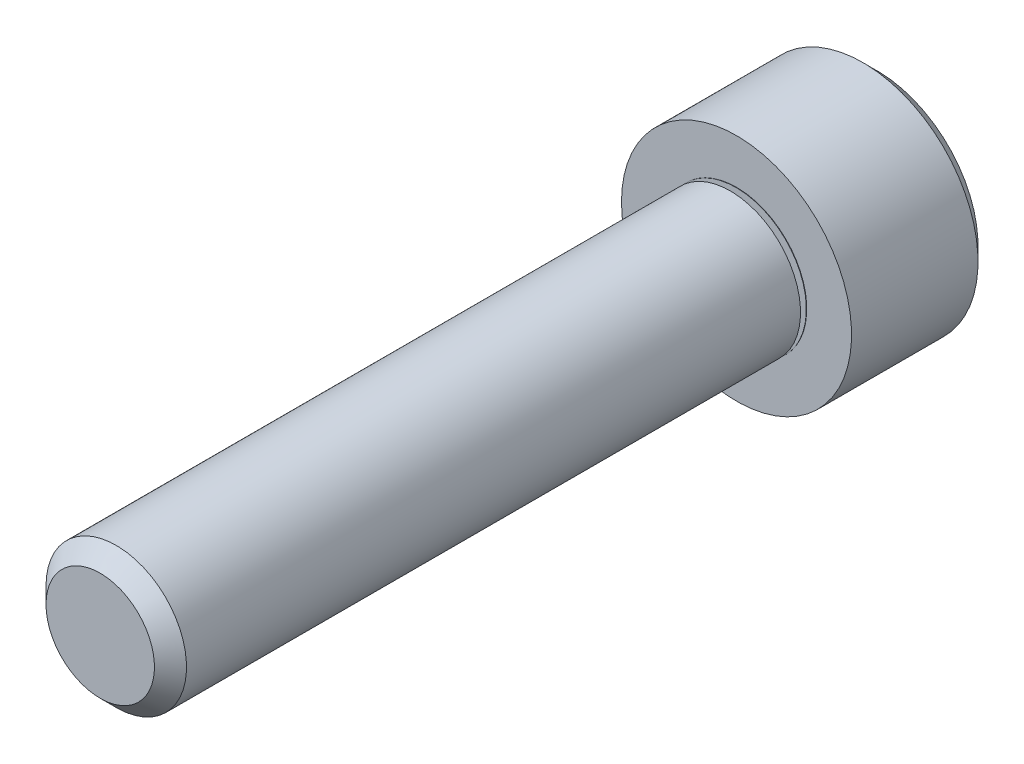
ISO-10303-21;
HEADER;
FILE_DESCRIPTION(('STEP AP214'),'2;1');
FILE_NAME('part.step','',(''),(''),'','','');
FILE_SCHEMA(('AUTOMOTIVE_DESIGN { 1 0 10303 214 1 1 1 1 }'));
ENDSEC;
DATA;
#1=APPLICATION_CONTEXT('core data for automotive mechanical design processes');
#2=APPLICATION_PROTOCOL_DEFINITION('international standard','automotive_design',2000,#1);
#3=PRODUCT_CONTEXT('',#1,'mechanical');
#4=PRODUCT('Part','Part','',(#3));
#5=PRODUCT_RELATED_PRODUCT_CATEGORY('part','',(#4));
#6=PRODUCT_DEFINITION_FORMATION('','',#4);
#7=PRODUCT_DEFINITION_CONTEXT('part definition',#1,'design');
#8=PRODUCT_DEFINITION('design','',#6,#7);
#9=PRODUCT_DEFINITION_SHAPE('','',#8);
#10=(LENGTH_UNIT() NAMED_UNIT(*) SI_UNIT(.MILLI.,.METRE.));
#11=(NAMED_UNIT(*) PLANE_ANGLE_UNIT() SI_UNIT($,.RADIAN.));
#12=(NAMED_UNIT(*) SI_UNIT($,.STERADIAN.) SOLID_ANGLE_UNIT());
#13=UNCERTAINTY_MEASURE_WITH_UNIT(LENGTH_MEASURE(1.E-05),#10,'distance_accuracy_value','');
#14=(GEOMETRIC_REPRESENTATION_CONTEXT(3) GLOBAL_UNCERTAINTY_ASSIGNED_CONTEXT((#13)) GLOBAL_UNIT_ASSIGNED_CONTEXT((#10,
#11,#12)) REPRESENTATION_CONTEXT('',''));
#15=CARTESIAN_POINT('',(0.,0.,0.));
#16=DIRECTION('',(0.,0.,1.));
#17=DIRECTION('',(1.,0.,0.));
#18=AXIS2_PLACEMENT_3D('',#15,#16,#17);
#19=CARTESIAN_POINT('',(0.,0.,-3.5052));
#20=DIRECTION('',(0.,0.,1.));
#21=DIRECTION('',(1.,0.,0.));
#22=AXIS2_PLACEMENT_3D('',#19,#20,#21);
#23=PLANE('',#22);
#24=DIRECTION('',(-0.5,-0.866025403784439,0.));
#25=VECTOR('',#24,1.);
#26=CARTESIAN_POINT('',(1.60395121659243,0.,-3.5052));
#27=LINE('',#26,#25);
#28=CARTESIAN_POINT('',(1.60395121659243,0.,-3.5052));
#29=VERTEX_POINT('',#28);
#30=CARTESIAN_POINT('',(0.80197560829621,-1.38906250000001,-3.5052));
#31=VERTEX_POINT('',#30);
#32=EDGE_CURVE('E145',#29,#31,#27,.T.);
#33=ORIENTED_EDGE('',*,*,#32,.F.);
#34=DIRECTION('',(0.5,-0.866025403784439,0.));
#35=VECTOR('',#34,1.);
#36=CARTESIAN_POINT('',(0.801975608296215,1.3890625,-3.5052));
#37=LINE('',#36,#35);
#38=CARTESIAN_POINT('',(0.801975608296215,1.3890625,-3.5052));
#39=VERTEX_POINT('',#38);
#40=EDGE_CURVE('E64',#39,#29,#37,.T.);
#41=ORIENTED_EDGE('',*,*,#40,.F.);
#42=DIRECTION('',(1.,0.,0.));
#43=VECTOR('',#42,1.);
#44=CARTESIAN_POINT('',(-0.801975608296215,1.3890625,-3.5052));
#45=LINE('',#44,#43);
#46=CARTESIAN_POINT('',(-0.801975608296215,1.3890625,-3.5052));
#47=VERTEX_POINT('',#46);
#48=EDGE_CURVE('E158',#47,#39,#45,.T.);
#49=ORIENTED_EDGE('',*,*,#48,.F.);
#50=DIRECTION('',(0.5,0.866025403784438,0.));
#51=VECTOR('',#50,1.);
#52=CARTESIAN_POINT('',(-1.60395121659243,0.,-3.5052));
#53=LINE('',#52,#51);
#54=CARTESIAN_POINT('',(-1.60395121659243,0.,-3.5052));
#55=VERTEX_POINT('',#54);
#56=EDGE_CURVE('E155',#55,#47,#53,.T.);
#57=ORIENTED_EDGE('',*,*,#56,.F.);
#58=DIRECTION('',(-0.499999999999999,0.866025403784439,0.));
#59=VECTOR('',#58,1.);
#60=CARTESIAN_POINT('',(-0.801975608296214,-1.38906250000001,-3.5052));
#61=LINE('',#60,#59);
#62=CARTESIAN_POINT('',(-0.801975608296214,-1.38906250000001,-3.5052));
#63=VERTEX_POINT('',#62);
#64=EDGE_CURVE('E112',#63,#55,#61,.T.);
#65=ORIENTED_EDGE('',*,*,#64,.F.);
#66=DIRECTION('',(-1.,0.,0.));
#67=VECTOR('',#66,1.);
#68=CARTESIAN_POINT('',(0.80197560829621,-1.38906250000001,-3.5052));
#69=LINE('',#68,#67);
#70=EDGE_CURVE('E149',#31,#63,#69,.T.);
#71=ORIENTED_EDGE('',*,*,#70,.F.);
#72=EDGE_LOOP('',(#33,#41,#49,#57,#65,#71));
#73=FACE_BOUND('',#72,.T.);
#74=CARTESIAN_POINT('',(0.,0.,-3.5052));
#75=DIRECTION('',(0.,0.,-1.));
#76=DIRECTION('',(-1.,0.,0.));
#77=AXIS2_PLACEMENT_3D('',#74,#75,#76);
#78=CIRCLE('',#77,2.51968);
#79=CARTESIAN_POINT('',(-2.51968,0.,-3.5052));
#80=VERTEX_POINT('',#79);
#81=EDGE_CURVE('E164',#80,#80,#78,.T.);
#82=ORIENTED_EDGE('',*,*,#81,.T.);
#83=EDGE_LOOP('',(#82));
#84=FACE_BOUND('',#83,.T.);
#85=ADVANCED_FACE('F49',(#73,#84),#23,.F.);
#86=CARTESIAN_POINT('',(-1.35255000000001,0.,15.875));
#87=DIRECTION('',(0.,0.,-1.));
#88=DIRECTION('',(-1.,0.,0.));
#89=AXIS2_PLACEMENT_3D('',#86,#87,#88);
#90=PLANE('',#89);
#91=CARTESIAN_POINT('',(0.,0.,15.875));
#92=DIRECTION('',(0.,0.,-1.));
#93=DIRECTION('',(-1.,0.,0.));
#94=AXIS2_PLACEMENT_3D('',#91,#92,#93);
#95=CIRCLE('',#94,1.35255000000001);
#96=CARTESIAN_POINT('',(-1.35255000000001,0.,15.875));
#97=VERTEX_POINT('',#96);
#98=EDGE_CURVE('E11',#97,#97,#95,.T.);
#99=ORIENTED_EDGE('',*,*,#98,.F.);
#100=EDGE_LOOP('',(#99));
#101=FACE_BOUND('',#100,.T.);
#102=ADVANCED_FACE('F214',(#101),#90,.F.);
#103=CARTESIAN_POINT('',(0.,0.,15.875));
#104=DIRECTION('',(0.,0.,-1.));
#105=DIRECTION('',(-1.,0.,0.));
#106=AXIS2_PLACEMENT_3D('',#103,#104,#105);
#107=CONICAL_SURFACE('',#106,1.35255000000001,0.785398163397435);
#108=CARTESIAN_POINT('',(0.,0.,15.47495));
#109=DIRECTION('',(0.,0.,-1.));
#110=DIRECTION('',(-1.,0.,0.));
#111=AXIS2_PLACEMENT_3D('',#108,#109,#110);
#112=CIRCLE('',#111,1.75260000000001);
#113=CARTESIAN_POINT('',(-1.75260000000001,0.,15.47495));
#114=VERTEX_POINT('',#113);
#115=EDGE_CURVE('E57',#114,#114,#112,.T.);
#116=ORIENTED_EDGE('',*,*,#115,.F.);
#117=EDGE_LOOP('',(#116));
#118=FACE_BOUND('',#117,.T.);
#119=ORIENTED_EDGE('',*,*,#98,.T.);
#120=EDGE_LOOP('',(#119));
#121=FACE_BOUND('',#120,.T.);
#122=ADVANCED_FACE('F211',(#118,#121),#107,.T.);
#123=CARTESIAN_POINT('',(0.,0.,-10.585154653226));
#124=DIRECTION('',(0.,0.,-1.));
#125=DIRECTION('',(-1.,0.,0.));
#126=AXIS2_PLACEMENT_3D('',#123,#124,#125);
#127=CYLINDRICAL_SURFACE('',#126,1.75260000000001);
#128=CARTESIAN_POINT('',(0.,0.,0.155606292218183));
#129=DIRECTION('',(0.,0.,-1.));
#130=DIRECTION('',(-1.,0.,0.));
#131=AXIS2_PLACEMENT_3D('',#128,#129,#130);
#132=CIRCLE('',#131,1.75260000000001);
#133=CARTESIAN_POINT('',(-1.75260000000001,0.,0.155606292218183));
#134=VERTEX_POINT('',#133);
#135=EDGE_CURVE('E201',#134,#134,#132,.T.);
#136=ORIENTED_EDGE('',*,*,#135,.F.);
#137=EDGE_LOOP('',(#136));
#138=FACE_BOUND('',#137,.T.);
#139=ORIENTED_EDGE('',*,*,#115,.T.);
#140=EDGE_LOOP('',(#139));
#141=FACE_BOUND('',#140,.T.);
#142=ADVANCED_FACE('F209',(#138,#141),#127,.T.);
#143=CARTESIAN_POINT('',(0.,0.,0.155606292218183));
#144=DIRECTION('',(0.,0.,1.));
#145=DIRECTION('',(1.,0.,0.));
#146=AXIS2_PLACEMENT_3D('',#143,#144,#145);
#147=CONICAL_SURFACE('',#146,1.75260000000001,1.22173047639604);
#148=CARTESIAN_POINT('',(0.,0.,0.0487938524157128));
#149=DIRECTION('',(0.,0.,-1.));
#150=DIRECTION('',(-1.,0.,0.));
#151=AXIS2_PLACEMENT_3D('',#148,#149,#150);
#152=CIRCLE('',#151,1.45913523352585);
#153=CARTESIAN_POINT('',(-1.45913523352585,0.,0.0487938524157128));
#154=VERTEX_POINT('',#153);
#155=EDGE_CURVE('E197',#154,#154,#152,.T.);
#156=ORIENTED_EDGE('',*,*,#155,.F.);
#157=EDGE_LOOP('',(#156));
#158=FACE_BOUND('',#157,.T.);
#159=ORIENTED_EDGE('',*,*,#135,.T.);
#160=EDGE_LOOP('',(#159));
#161=FACE_BOUND('',#160,.T.);
#162=ADVANCED_FACE('F226',(#158,#161),#147,.T.);
#163=CARTESIAN_POINT('',(0.,0.,0.0300000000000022));
#164=DIRECTION('',(0.,0.,-1.));
#165=DIRECTION('',(-1.,0.,0.));
#166=AXIS2_PLACEMENT_3D('',#163,#164,#165);
#167=TOROIDAL_SURFACE('',#166,1.46597563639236,0.0199999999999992);
#168=CARTESIAN_POINT('',(0.,0.,0.0100000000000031));
#169=DIRECTION('',(0.,0.,-1.));
#170=DIRECTION('',(-1.,0.,0.));
#171=AXIS2_PLACEMENT_3D('',#168,#169,#170);
#172=CIRCLE('',#171,1.46597563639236);
#173=CARTESIAN_POINT('',(-1.46597563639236,0.,0.0100000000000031));
#174=VERTEX_POINT('',#173);
#175=EDGE_CURVE('E193',#174,#174,#172,.T.);
#176=ORIENTED_EDGE('',*,*,#175,.F.);
#177=EDGE_LOOP('',(#176));
#178=FACE_BOUND('',#177,.T.);
#179=ORIENTED_EDGE('',*,*,#155,.T.);
#180=EDGE_LOOP('',(#179));
#181=FACE_BOUND('',#180,.T.);
#182=ADVANCED_FACE('F230',(#178,#181),#167,.F.);
#183=CARTESIAN_POINT('',(-1.7526,0.,0.00999999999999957));
#184=DIRECTION('',(0.,0.,-1.));
#185=DIRECTION('',(-1.,0.,0.));
#186=AXIS2_PLACEMENT_3D('',#183,#184,#185);
#187=PLANE('',#186);
#188=CARTESIAN_POINT('',(0.,0.,0.00999999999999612));
#189=DIRECTION('',(0.,0.,-1.));
#190=DIRECTION('',(-1.,0.,0.));
#191=AXIS2_PLACEMENT_3D('',#188,#189,#190);
#192=CIRCLE('',#191,1.7526);
#193=CARTESIAN_POINT('',(-1.7526,0.,0.00999999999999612));
#194=VERTEX_POINT('',#193);
#195=EDGE_CURVE('E189',#194,#194,#192,.T.);
#196=ORIENTED_EDGE('',*,*,#195,.F.);
#197=EDGE_LOOP('',(#196));
#198=FACE_BOUND('',#197,.T.);
#199=ORIENTED_EDGE('',*,*,#175,.T.);
#200=EDGE_LOOP('',(#199));
#201=FACE_BOUND('',#200,.T.);
#202=ADVANCED_FACE('F234',(#198,#201),#187,.F.);
#203=CARTESIAN_POINT('',(0.,0.,-10.585154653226));
#204=DIRECTION('',(0.,0.,-1.));
#205=DIRECTION('',(-1.,0.,0.));
#206=AXIS2_PLACEMENT_3D('',#203,#204,#205);
#207=CYLINDRICAL_SURFACE('',#206,1.7526);
#208=CARTESIAN_POINT('',(0.,0.,0.));
#209=DIRECTION('',(0.,0.,-1.));
#210=DIRECTION('',(-1.,0.,0.));
#211=AXIS2_PLACEMENT_3D('',#208,#209,#210);
#212=CIRCLE('',#211,1.7526);
#213=CARTESIAN_POINT('',(-1.7526,0.,0.));
#214=VERTEX_POINT('',#213);
#215=EDGE_CURVE('E185',#214,#214,#212,.T.);
#216=ORIENTED_EDGE('',*,*,#215,.F.);
#217=EDGE_LOOP('',(#216));
#218=FACE_BOUND('',#217,.T.);
#219=ORIENTED_EDGE('',*,*,#195,.T.);
#220=EDGE_LOOP('',(#219));
#221=FACE_BOUND('',#220,.T.);
#222=ADVANCED_FACE('F238',(#218,#221),#207,.T.);
#223=CARTESIAN_POINT('',(-2.8702,0.,0.));
#224=DIRECTION('',(0.,0.,-1.));
#225=DIRECTION('',(-1.,0.,0.));
#226=AXIS2_PLACEMENT_3D('',#223,#224,#225);
#227=PLANE('',#226);
#228=CARTESIAN_POINT('',(0.,0.,0.));
#229=DIRECTION('',(0.,0.,-1.));
#230=DIRECTION('',(-1.,0.,0.));
#231=AXIS2_PLACEMENT_3D('',#228,#229,#230);
#232=CIRCLE('',#231,2.8702);
#233=CARTESIAN_POINT('',(-2.8702,0.,0.));
#234=VERTEX_POINT('',#233);
#235=EDGE_CURVE('E181',#234,#234,#232,.T.);
#236=ORIENTED_EDGE('',*,*,#235,.F.);
#237=EDGE_LOOP('',(#236));
#238=FACE_BOUND('',#237,.T.);
#239=ORIENTED_EDGE('',*,*,#215,.T.);
#240=EDGE_LOOP('',(#239));
#241=FACE_BOUND('',#240,.T.);
#242=ADVANCED_FACE('F242',(#238,#241),#227,.F.);
#243=CARTESIAN_POINT('',(0.,0.,-10.585154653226));
#244=DIRECTION('',(0.,0.,-1.));
#245=DIRECTION('',(-1.,0.,0.));
#246=AXIS2_PLACEMENT_3D('',#243,#244,#245);
#247=CYLINDRICAL_SURFACE('',#246,2.8702);
#248=CARTESIAN_POINT('',(0.,0.,-3.15468));
#249=DIRECTION('',(0.,0.,-1.));
#250=DIRECTION('',(-1.,0.,0.));
#251=AXIS2_PLACEMENT_3D('',#248,#249,#250);
#252=CIRCLE('',#251,2.8702);
#253=CARTESIAN_POINT('',(-2.8702,0.,-3.15468));
#254=VERTEX_POINT('',#253);
#255=EDGE_CURVE('E177',#254,#254,#252,.T.);
#256=ORIENTED_EDGE('',*,*,#255,.F.);
#257=EDGE_LOOP('',(#256));
#258=FACE_BOUND('',#257,.T.);
#259=ORIENTED_EDGE('',*,*,#235,.T.);
#260=EDGE_LOOP('',(#259));
#261=FACE_BOUND('',#260,.T.);
#262=ADVANCED_FACE('F246',(#258,#261),#247,.T.);
#263=CARTESIAN_POINT('',(0.,0.,-3.15468));
#264=DIRECTION('',(0.,0.,1.));
#265=DIRECTION('',(1.,0.,0.));
#266=AXIS2_PLACEMENT_3D('',#263,#264,#265);
#267=CONICAL_SURFACE('',#266,2.8702,0.785398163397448);
#268=ORIENTED_EDGE('',*,*,#81,.F.);
#269=EDGE_LOOP('',(#268));
#270=FACE_BOUND('',#269,.T.);
#271=ORIENTED_EDGE('',*,*,#255,.T.);
#272=EDGE_LOOP('',(#271));
#273=FACE_BOUND('',#272,.T.);
#274=ADVANCED_FACE('F250',(#270,#273),#267,.T.);
#275=CARTESIAN_POINT('',(0.801975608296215,1.3890625,-1.7526));
#276=DIRECTION('',(0.866025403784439,0.5,0.));
#277=DIRECTION('',(-0.5,0.866025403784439,0.));
#278=AXIS2_PLACEMENT_3D('',#275,#276,#277);
#279=PLANE('',#278);
#280=ORIENTED_EDGE('',*,*,#40,.T.);
#281=DIRECTION('',(0.,0.,-1.));
#282=VECTOR('',#281,1.);
#283=CARTESIAN_POINT('',(1.60395121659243,0.,-1.7526));
#284=LINE('',#283,#282);
#285=CARTESIAN_POINT('',(1.60395121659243,0.,-1.7526));
#286=VERTEX_POINT('',#285);
#287=EDGE_CURVE('E94',#286,#29,#284,.T.);
#288=ORIENTED_EDGE('',*,*,#287,.F.);
#289=DIRECTION('',(0.5,-0.866025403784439,0.));
#290=VECTOR('',#289,1.);
#291=CARTESIAN_POINT('',(0.801975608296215,1.3890625,-1.7526));
#292=LINE('',#291,#290);
#293=CARTESIAN_POINT('',(0.801975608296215,1.3890625,-1.7526));
#294=VERTEX_POINT('',#293);
#295=EDGE_CURVE('E161',#294,#286,#292,.T.);
#296=ORIENTED_EDGE('',*,*,#295,.F.);
#297=DIRECTION('',(0.,0.,-1.));
#298=VECTOR('',#297,1.);
#299=CARTESIAN_POINT('',(0.801975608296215,1.3890625,-1.7526));
#300=LINE('',#299,#298);
#301=EDGE_CURVE('E72',#294,#39,#300,.T.);
#302=ORIENTED_EDGE('',*,*,#301,.T.);
#303=EDGE_LOOP('',(#280,#288,#296,#302));
#304=FACE_BOUND('',#303,.T.);
#305=ADVANCED_FACE('F254',(#304),#279,.F.);
#306=CARTESIAN_POINT('',(-0.801975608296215,1.3890625,-1.7526));
#307=DIRECTION('',(0.,1.,0.));
#308=DIRECTION('',(0.,0.,1.));
#309=AXIS2_PLACEMENT_3D('',#306,#307,#308);
#310=PLANE('',#309);
#311=ORIENTED_EDGE('',*,*,#48,.T.);
#312=ORIENTED_EDGE('',*,*,#301,.F.);
#313=DIRECTION('',(1.,0.,0.));
#314=VECTOR('',#313,1.);
#315=CARTESIAN_POINT('',(-0.801975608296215,1.3890625,-1.7526));
#316=LINE('',#315,#314);
#317=CARTESIAN_POINT('',(-0.801975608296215,1.3890625,-1.7526));
#318=VERTEX_POINT('',#317);
#319=EDGE_CURVE('E126',#318,#294,#316,.T.);
#320=ORIENTED_EDGE('',*,*,#319,.F.);
#321=DIRECTION('',(0.,0.,-1.));
#322=VECTOR('',#321,1.);
#323=CARTESIAN_POINT('',(-0.801975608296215,1.3890625,-1.7526));
#324=LINE('',#323,#322);
#325=EDGE_CURVE('E117',#318,#47,#324,.T.);
#326=ORIENTED_EDGE('',*,*,#325,.T.);
#327=EDGE_LOOP('',(#311,#312,#320,#326));
#328=FACE_BOUND('',#327,.T.);
#329=ADVANCED_FACE('F258',(#328),#310,.F.);
#330=CARTESIAN_POINT('',(-1.60395121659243,0.,-1.7526));
#331=DIRECTION('',(-0.866025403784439,0.5,0.));
#332=DIRECTION('',(-0.5,-0.866025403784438,0.));
#333=AXIS2_PLACEMENT_3D('',#330,#331,#332);
#334=PLANE('',#333);
#335=ORIENTED_EDGE('',*,*,#56,.T.);
#336=ORIENTED_EDGE('',*,*,#325,.F.);
#337=DIRECTION('',(0.5,0.866025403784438,0.));
#338=VECTOR('',#337,1.);
#339=CARTESIAN_POINT('',(-1.60395121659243,0.,-1.7526));
#340=LINE('',#339,#338);
#341=CARTESIAN_POINT('',(-1.60395121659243,0.,-1.7526));
#342=VERTEX_POINT('',#341);
#343=EDGE_CURVE('E121',#342,#318,#340,.T.);
#344=ORIENTED_EDGE('',*,*,#343,.F.);
#345=DIRECTION('',(0.,0.,-1.));
#346=VECTOR('',#345,1.);
#347=CARTESIAN_POINT('',(-1.60395121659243,0.,-1.7526));
#348=LINE('',#347,#346);
#349=EDGE_CURVE('E105',#342,#55,#348,.T.);
#350=ORIENTED_EDGE('',*,*,#349,.T.);
#351=EDGE_LOOP('',(#335,#336,#344,#350));
#352=FACE_BOUND('',#351,.T.);
#353=ADVANCED_FACE('F122',(#352),#334,.F.);
#354=CARTESIAN_POINT('',(-0.801975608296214,-1.38906250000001,-1.7526));
#355=DIRECTION('',(-0.866025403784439,-0.5,0.));
#356=DIRECTION('',(0.5,-0.866025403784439,0.));
#357=AXIS2_PLACEMENT_3D('',#354,#355,#356);
#358=PLANE('',#357);
#359=ORIENTED_EDGE('',*,*,#64,.T.);
#360=ORIENTED_EDGE('',*,*,#349,.F.);
#361=DIRECTION('',(-0.499999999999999,0.866025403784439,0.));
#362=VECTOR('',#361,1.);
#363=CARTESIAN_POINT('',(-0.801975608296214,-1.38906250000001,-1.7526));
#364=LINE('',#363,#362);
#365=CARTESIAN_POINT('',(-0.801975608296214,-1.38906250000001,-1.7526));
#366=VERTEX_POINT('',#365);
#367=EDGE_CURVE('E109',#366,#342,#364,.T.);
#368=ORIENTED_EDGE('',*,*,#367,.F.);
#369=DIRECTION('',(0.,0.,-1.));
#370=VECTOR('',#369,1.);
#371=CARTESIAN_POINT('',(-0.801975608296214,-1.38906250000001,-1.7526));
#372=LINE('',#371,#370);
#373=EDGE_CURVE('E118',#366,#63,#372,.T.);
#374=ORIENTED_EDGE('',*,*,#373,.T.);
#375=EDGE_LOOP('',(#359,#360,#368,#374));
#376=FACE_BOUND('',#375,.T.);
#377=ADVANCED_FACE('F107',(#376),#358,.F.);
#378=CARTESIAN_POINT('',(0.80197560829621,-1.38906250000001,-1.7526));
#379=DIRECTION('',(0.,-1.,0.));
#380=DIRECTION('',(0.,0.,-1.));
#381=AXIS2_PLACEMENT_3D('',#378,#379,#380);
#382=PLANE('',#381);
#383=ORIENTED_EDGE('',*,*,#70,.T.);
#384=ORIENTED_EDGE('',*,*,#373,.F.);
#385=DIRECTION('',(-1.,0.,0.));
#386=VECTOR('',#385,1.);
#387=CARTESIAN_POINT('',(0.80197560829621,-1.38906250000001,-1.7526));
#388=LINE('',#387,#386);
#389=CARTESIAN_POINT('',(0.80197560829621,-1.38906250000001,-1.7526));
#390=VERTEX_POINT('',#389);
#391=EDGE_CURVE('E132',#390,#366,#388,.T.);
#392=ORIENTED_EDGE('',*,*,#391,.F.);
#393=DIRECTION('',(0.,0.,-1.));
#394=VECTOR('',#393,1.);
#395=CARTESIAN_POINT('',(0.80197560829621,-1.38906250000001,-1.7526));
#396=LINE('',#395,#394);
#397=EDGE_CURVE('E169',#390,#31,#396,.T.);
#398=ORIENTED_EDGE('',*,*,#397,.T.);
#399=EDGE_LOOP('',(#383,#384,#392,#398));
#400=FACE_BOUND('',#399,.T.);
#401=ADVANCED_FACE('F262',(#400),#382,.F.);
#402=CARTESIAN_POINT('',(1.60395121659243,0.,-1.7526));
#403=DIRECTION('',(0.866025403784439,-0.5,0.));
#404=DIRECTION('',(0.5,0.866025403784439,0.));
#405=AXIS2_PLACEMENT_3D('',#402,#403,#404);
#406=PLANE('',#405);
#407=ORIENTED_EDGE('',*,*,#32,.T.);
#408=ORIENTED_EDGE('',*,*,#397,.F.);
#409=DIRECTION('',(-0.5,-0.866025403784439,0.));
#410=VECTOR('',#409,1.);
#411=CARTESIAN_POINT('',(1.60395121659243,0.,-1.7526));
#412=LINE('',#411,#410);
#413=EDGE_CURVE('E137',#286,#390,#412,.T.);
#414=ORIENTED_EDGE('',*,*,#413,.F.);
#415=ORIENTED_EDGE('',*,*,#287,.T.);
#416=EDGE_LOOP('',(#407,#408,#414,#415));
#417=FACE_BOUND('',#416,.T.);
#418=ADVANCED_FACE('F259',(#417),#406,.F.);
#419=CARTESIAN_POINT('',(0.,2.778125,-1.7526));
#420=DIRECTION('',(0.,0.,1.));
#421=DIRECTION('',(1.,0.,0.));
#422=AXIS2_PLACEMENT_3D('',#419,#420,#421);
#423=PLANE('',#422);
#424=ORIENTED_EDGE('',*,*,#295,.T.);
#425=ORIENTED_EDGE('',*,*,#413,.T.);
#426=ORIENTED_EDGE('',*,*,#391,.T.);
#427=ORIENTED_EDGE('',*,*,#367,.T.);
#428=ORIENTED_EDGE('',*,*,#343,.T.);
#429=ORIENTED_EDGE('',*,*,#319,.T.);
#430=EDGE_LOOP('',(#424,#425,#426,#427,#428,#429));
#431=FACE_BOUND('',#430,.T.);
#432=ADVANCED_FACE('F129',(#431),#423,.F.);
#433=CLOSED_SHELL('',(#85,#102,#122,#142,#162,#182,#202,#222,#242,#262,#274,#305,#329,#353,#377,
#401,#418,#432));
#434=MANIFOLD_SOLID_BREP('B2',#433);
#435=ADVANCED_BREP_SHAPE_REPRESENTATION('',(#18,#434),#14);
#436=SHAPE_DEFINITION_REPRESENTATION(#9,#435);
ENDSEC;
END-ISO-10303-21;
